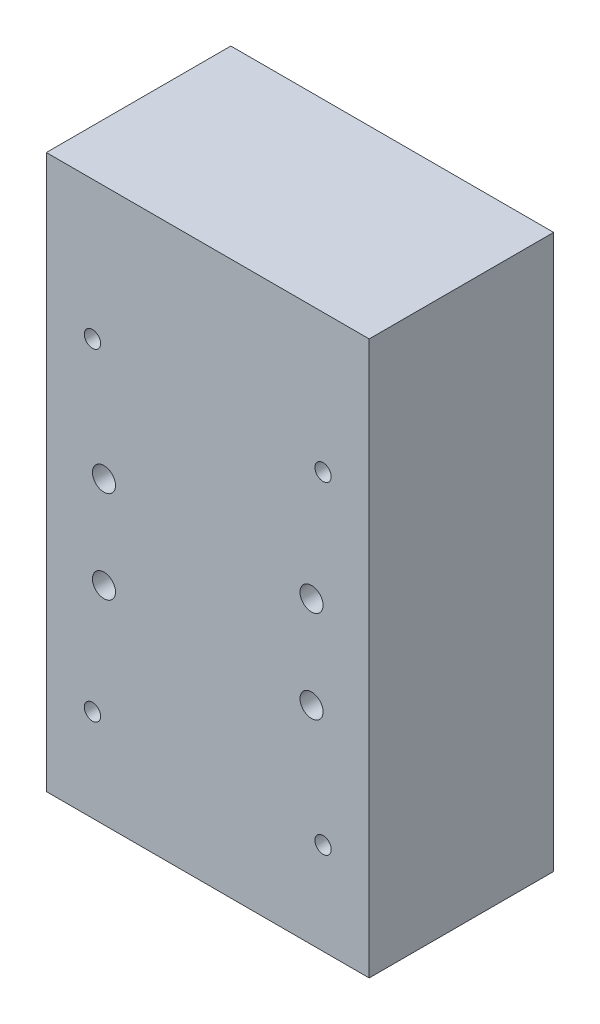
ISO-10303-21;
HEADER;
FILE_DESCRIPTION(('STEP AP214'),'2;1');
FILE_NAME('part.step','',(''),(''),'','','');
FILE_SCHEMA(('AUTOMOTIVE_DESIGN { 1 0 10303 214 1 1 1 1 }'));
ENDSEC;
DATA;
#1=APPLICATION_CONTEXT('core data for automotive mechanical design processes');
#2=APPLICATION_PROTOCOL_DEFINITION('international standard','automotive_design',2000,#1);
#3=PRODUCT_CONTEXT('',#1,'mechanical');
#4=PRODUCT('Part','Part','',(#3));
#5=PRODUCT_RELATED_PRODUCT_CATEGORY('part','',(#4));
#6=PRODUCT_DEFINITION_FORMATION('','',#4);
#7=PRODUCT_DEFINITION_CONTEXT('part definition',#1,'design');
#8=PRODUCT_DEFINITION('design','',#6,#7);
#9=PRODUCT_DEFINITION_SHAPE('','',#8);
#10=(LENGTH_UNIT() NAMED_UNIT(*) SI_UNIT(.MILLI.,.METRE.));
#11=(NAMED_UNIT(*) PLANE_ANGLE_UNIT() SI_UNIT($,.RADIAN.));
#12=(NAMED_UNIT(*) SI_UNIT($,.STERADIAN.) SOLID_ANGLE_UNIT());
#13=UNCERTAINTY_MEASURE_WITH_UNIT(LENGTH_MEASURE(1.E-05),#10,'distance_accuracy_value','');
#14=(GEOMETRIC_REPRESENTATION_CONTEXT(3) GLOBAL_UNCERTAINTY_ASSIGNED_CONTEXT((#13)) GLOBAL_UNIT_ASSIGNED_CONTEXT((#10,
#11,#12)) REPRESENTATION_CONTEXT('',''));
#15=CARTESIAN_POINT('',(0.,0.,0.));
#16=DIRECTION('',(0.,0.,1.));
#17=DIRECTION('',(1.,0.,0.));
#18=AXIS2_PLACEMENT_3D('',#15,#16,#17);
#19=CARTESIAN_POINT('',(-44.45,152.4,-25.4));
#20=DIRECTION('',(0.,0.,1.));
#21=DIRECTION('',(1.,0.,0.));
#22=AXIS2_PLACEMENT_3D('',#19,#20,#21);
#23=PLANE('',#22);
#24=CARTESIAN_POINT('',(28.5750000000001,82.5093987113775,-25.4000000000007));
#25=DIRECTION('',(0.,0.,-1.));
#26=DIRECTION('',(-1.,0.,0.));
#27=AXIS2_PLACEMENT_3D('',#24,#25,#26);
#28=CIRCLE('',#27,3.175);
#29=CARTESIAN_POINT('',(25.4000000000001,82.5093987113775,-25.4000000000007));
#30=VERTEX_POINT('',#29);
#31=EDGE_CURVE('E157',#30,#30,#28,.T.);
#32=ORIENTED_EDGE('',*,*,#31,.F.);
#33=EDGE_LOOP('',(#32));
#34=FACE_BOUND('',#33,.T.);
#35=CARTESIAN_POINT('',(-28.5749999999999,57.1093987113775,-25.4000000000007));
#36=DIRECTION('',(0.,0.,-1.));
#37=DIRECTION('',(-1.,0.,0.));
#38=AXIS2_PLACEMENT_3D('',#35,#36,#37);
#39=CIRCLE('',#38,3.175);
#40=CARTESIAN_POINT('',(-31.7499999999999,57.1093987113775,-25.4000000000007));
#41=VERTEX_POINT('',#40);
#42=EDGE_CURVE('E147',#41,#41,#39,.T.);
#43=ORIENTED_EDGE('',*,*,#42,.F.);
#44=EDGE_LOOP('',(#43));
#45=FACE_BOUND('',#44,.T.);
#46=CARTESIAN_POINT('',(31.75,114.3,-25.4));
#47=DIRECTION('',(0.,0.,-1.));
#48=DIRECTION('',(-1.,0.,0.));
#49=AXIS2_PLACEMENT_3D('',#46,#47,#48);
#50=CIRCLE('',#49,4.2164);
#51=CARTESIAN_POINT('',(27.5336,114.3,-25.4));
#52=VERTEX_POINT('',#51);
#53=EDGE_CURVE('E143',#52,#52,#50,.T.);
#54=ORIENTED_EDGE('',*,*,#53,.F.);
#55=EDGE_LOOP('',(#54));
#56=FACE_BOUND('',#55,.T.);
#57=CARTESIAN_POINT('',(-31.75,114.3,-25.4));
#58=DIRECTION('',(0.,0.,-1.));
#59=DIRECTION('',(-1.,0.,0.));
#60=AXIS2_PLACEMENT_3D('',#57,#58,#59);
#61=CIRCLE('',#60,4.2164);
#62=CARTESIAN_POINT('',(-35.9664,114.3,-25.4));
#63=VERTEX_POINT('',#62);
#64=EDGE_CURVE('E134',#63,#63,#61,.T.);
#65=ORIENTED_EDGE('',*,*,#64,.F.);
#66=EDGE_LOOP('',(#65));
#67=FACE_BOUND('',#66,.T.);
#68=CARTESIAN_POINT('',(31.75,25.4,-25.4));
#69=DIRECTION('',(0.,0.,-1.));
#70=DIRECTION('',(-1.,0.,0.));
#71=AXIS2_PLACEMENT_3D('',#68,#69,#70);
#72=CIRCLE('',#71,4.2164);
#73=CARTESIAN_POINT('',(27.5336,25.4,-25.4));
#74=VERTEX_POINT('',#73);
#75=EDGE_CURVE('E125',#74,#74,#72,.T.);
#76=ORIENTED_EDGE('',*,*,#75,.F.);
#77=EDGE_LOOP('',(#76));
#78=FACE_BOUND('',#77,.T.);
#79=CARTESIAN_POINT('',(-31.75,25.4,-25.4));
#80=DIRECTION('',(0.,0.,-1.));
#81=DIRECTION('',(-1.,0.,0.));
#82=AXIS2_PLACEMENT_3D('',#79,#80,#81);
#83=CIRCLE('',#82,4.2164);
#84=CARTESIAN_POINT('',(-35.9664,25.4,-25.4));
#85=VERTEX_POINT('',#84);
#86=EDGE_CURVE('E116',#85,#85,#83,.T.);
#87=ORIENTED_EDGE('',*,*,#86,.F.);
#88=EDGE_LOOP('',(#87));
#89=FACE_BOUND('',#88,.T.);
#90=DIRECTION('',(-1.,0.,0.));
#91=VECTOR('',#90,1.);
#92=CARTESIAN_POINT('',(-44.45,0.,-25.4));
#93=LINE('',#92,#91);
#94=CARTESIAN_POINT('',(44.45,0.,-25.4));
#95=VERTEX_POINT('',#94);
#96=CARTESIAN_POINT('',(-44.45,0.,-25.4));
#97=VERTEX_POINT('',#96);
#98=EDGE_CURVE('E88',#95,#97,#93,.T.);
#99=ORIENTED_EDGE('',*,*,#98,.T.);
#100=DIRECTION('',(0.,-1.,0.));
#101=VECTOR('',#100,1.);
#102=CARTESIAN_POINT('',(-44.45,152.4,-25.4));
#103=LINE('',#102,#101);
#104=CARTESIAN_POINT('',(-44.45,152.4,-25.4));
#105=VERTEX_POINT('',#104);
#106=EDGE_CURVE('E41',#105,#97,#103,.T.);
#107=ORIENTED_EDGE('',*,*,#106,.F.);
#108=DIRECTION('',(-1.,0.,0.));
#109=VECTOR('',#108,1.);
#110=CARTESIAN_POINT('',(-44.45,152.4,-25.4));
#111=LINE('',#110,#109);
#112=CARTESIAN_POINT('',(44.45,152.4,-25.4));
#113=VERTEX_POINT('',#112);
#114=EDGE_CURVE('E79',#113,#105,#111,.T.);
#115=ORIENTED_EDGE('',*,*,#114,.F.);
#116=DIRECTION('',(0.,-1.,0.));
#117=VECTOR('',#116,1.);
#118=CARTESIAN_POINT('',(44.45,152.4,-25.4));
#119=LINE('',#118,#117);
#120=EDGE_CURVE('E11',#113,#95,#119,.T.);
#121=ORIENTED_EDGE('',*,*,#120,.T.);
#122=EDGE_LOOP('',(#99,#107,#115,#121));
#123=FACE_BOUND('',#122,.T.);
#124=CARTESIAN_POINT('',(-28.5749999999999,82.5093987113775,-25.4000000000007));
#125=DIRECTION('',(0.,0.,1.));
#126=DIRECTION('',(1.,0.,0.));
#127=AXIS2_PLACEMENT_3D('',#124,#125,#126);
#128=CIRCLE('',#127,3.175);
#129=CARTESIAN_POINT('',(-25.3999999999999,82.5093987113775,-25.4000000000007));
#130=VERTEX_POINT('',#129);
#131=EDGE_CURVE('E156',#130,#130,#128,.T.);
#132=ORIENTED_EDGE('',*,*,#131,.T.);
#133=EDGE_LOOP('',(#132));
#134=FACE_BOUND('',#133,.T.);
#135=CARTESIAN_POINT('',(28.5750000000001,57.1093987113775,-25.4000000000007));
#136=DIRECTION('',(0.,0.,1.));
#137=DIRECTION('',(1.,0.,0.));
#138=AXIS2_PLACEMENT_3D('',#135,#136,#137);
#139=CIRCLE('',#138,3.175);
#140=CARTESIAN_POINT('',(31.7500000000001,57.1093987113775,-25.4000000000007));
#141=VERTEX_POINT('',#140);
#142=EDGE_CURVE('E150',#141,#141,#139,.T.);
#143=ORIENTED_EDGE('',*,*,#142,.T.);
#144=EDGE_LOOP('',(#143));
#145=FACE_BOUND('',#144,.T.);
#146=ADVANCED_FACE('F32',(#34,#45,#56,#67,#78,#89,#123,#134,#145),#23,.F.);
#147=CARTESIAN_POINT('',(-44.45,152.4,25.4));
#148=DIRECTION('',(0.,0.,-1.));
#149=DIRECTION('',(-1.,0.,0.));
#150=AXIS2_PLACEMENT_3D('',#147,#148,#149);
#151=PLANE('',#150);
#152=CARTESIAN_POINT('',(28.5750000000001,82.5093987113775,25.4));
#153=DIRECTION('',(0.,0.,-1.));
#154=DIRECTION('',(-1.,0.,0.));
#155=AXIS2_PLACEMENT_3D('',#152,#153,#154);
#156=CIRCLE('',#155,3.175);
#157=CARTESIAN_POINT('',(25.4000000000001,82.5093987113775,25.4));
#158=VERTEX_POINT('',#157);
#159=EDGE_CURVE('E165',#158,#158,#156,.T.);
#160=ORIENTED_EDGE('',*,*,#159,.T.);
#161=EDGE_LOOP('',(#160));
#162=FACE_BOUND('',#161,.T.);
#163=CARTESIAN_POINT('',(-28.5749999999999,57.1093987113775,25.4));
#164=DIRECTION('',(0.,0.,-1.));
#165=DIRECTION('',(-1.,0.,0.));
#166=AXIS2_PLACEMENT_3D('',#163,#164,#165);
#167=CIRCLE('',#166,3.175);
#168=CARTESIAN_POINT('',(-31.7499999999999,57.1093987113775,25.4));
#169=VERTEX_POINT('',#168);
#170=EDGE_CURVE('E146',#169,#169,#167,.T.);
#171=ORIENTED_EDGE('',*,*,#170,.T.);
#172=EDGE_LOOP('',(#171));
#173=FACE_BOUND('',#172,.T.);
#174=CARTESIAN_POINT('',(31.75,114.3,25.4));
#175=DIRECTION('',(0.,0.,-1.));
#176=DIRECTION('',(-1.,0.,0.));
#177=AXIS2_PLACEMENT_3D('',#174,#175,#176);
#178=CIRCLE('',#177,2.24789999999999);
#179=CARTESIAN_POINT('',(29.5021,114.3,25.4));
#180=VERTEX_POINT('',#179);
#181=EDGE_CURVE('E137',#180,#180,#178,.T.);
#182=ORIENTED_EDGE('',*,*,#181,.T.);
#183=EDGE_LOOP('',(#182));
#184=FACE_BOUND('',#183,.T.);
#185=CARTESIAN_POINT('',(-31.75,114.3,25.4));
#186=DIRECTION('',(0.,0.,-1.));
#187=DIRECTION('',(-1.,0.,0.));
#188=AXIS2_PLACEMENT_3D('',#185,#186,#187);
#189=CIRCLE('',#188,2.24789999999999);
#190=CARTESIAN_POINT('',(-33.9979,114.3,25.4));
#191=VERTEX_POINT('',#190);
#192=EDGE_CURVE('E128',#191,#191,#189,.T.);
#193=ORIENTED_EDGE('',*,*,#192,.T.);
#194=EDGE_LOOP('',(#193));
#195=FACE_BOUND('',#194,.T.);
#196=CARTESIAN_POINT('',(31.75,25.4,25.4));
#197=DIRECTION('',(0.,0.,-1.));
#198=DIRECTION('',(-1.,0.,0.));
#199=AXIS2_PLACEMENT_3D('',#196,#197,#198);
#200=CIRCLE('',#199,2.24789999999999);
#201=CARTESIAN_POINT('',(29.5021,25.4,25.4));
#202=VERTEX_POINT('',#201);
#203=EDGE_CURVE('E119',#202,#202,#200,.T.);
#204=ORIENTED_EDGE('',*,*,#203,.T.);
#205=EDGE_LOOP('',(#204));
#206=FACE_BOUND('',#205,.T.);
#207=CARTESIAN_POINT('',(-31.75,25.4,25.4));
#208=DIRECTION('',(0.,0.,-1.));
#209=DIRECTION('',(-1.,0.,0.));
#210=AXIS2_PLACEMENT_3D('',#207,#208,#209);
#211=CIRCLE('',#210,2.24789999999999);
#212=CARTESIAN_POINT('',(-33.9979,25.4,25.4));
#213=VERTEX_POINT('',#212);
#214=EDGE_CURVE('E99',#213,#213,#211,.T.);
#215=ORIENTED_EDGE('',*,*,#214,.T.);
#216=EDGE_LOOP('',(#215));
#217=FACE_BOUND('',#216,.T.);
#218=DIRECTION('',(1.,0.,0.));
#219=VECTOR('',#218,1.);
#220=CARTESIAN_POINT('',(-44.45,0.,25.4));
#221=LINE('',#220,#219);
#222=CARTESIAN_POINT('',(-44.45,0.,25.4));
#223=VERTEX_POINT('',#222);
#224=CARTESIAN_POINT('',(44.45,0.,25.4));
#225=VERTEX_POINT('',#224);
#226=EDGE_CURVE('E72',#223,#225,#221,.T.);
#227=ORIENTED_EDGE('',*,*,#226,.T.);
#228=DIRECTION('',(0.,-1.,0.));
#229=VECTOR('',#228,1.);
#230=CARTESIAN_POINT('',(44.45,152.4,25.4));
#231=LINE('',#230,#229);
#232=CARTESIAN_POINT('',(44.45,152.4,25.4));
#233=VERTEX_POINT('',#232);
#234=EDGE_CURVE('E92',#233,#225,#231,.T.);
#235=ORIENTED_EDGE('',*,*,#234,.F.);
#236=DIRECTION('',(1.,0.,0.));
#237=VECTOR('',#236,1.);
#238=CARTESIAN_POINT('',(-44.45,152.4,25.4));
#239=LINE('',#238,#237);
#240=CARTESIAN_POINT('',(-44.45,152.4,25.4));
#241=VERTEX_POINT('',#240);
#242=EDGE_CURVE('E49',#241,#233,#239,.T.);
#243=ORIENTED_EDGE('',*,*,#242,.F.);
#244=DIRECTION('',(0.,-1.,0.));
#245=VECTOR('',#244,1.);
#246=CARTESIAN_POINT('',(-44.45,152.4,25.4));
#247=LINE('',#246,#245);
#248=EDGE_CURVE('E89',#241,#223,#247,.T.);
#249=ORIENTED_EDGE('',*,*,#248,.T.);
#250=EDGE_LOOP('',(#227,#235,#243,#249));
#251=FACE_BOUND('',#250,.T.);
#252=CARTESIAN_POINT('',(-28.5749999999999,82.5093987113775,25.4));
#253=DIRECTION('',(0.,0.,1.));
#254=DIRECTION('',(1.,0.,0.));
#255=AXIS2_PLACEMENT_3D('',#252,#253,#254);
#256=CIRCLE('',#255,3.175);
#257=CARTESIAN_POINT('',(-25.3999999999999,82.5093987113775,25.4));
#258=VERTEX_POINT('',#257);
#259=EDGE_CURVE('E153',#258,#258,#256,.T.);
#260=ORIENTED_EDGE('',*,*,#259,.F.);
#261=EDGE_LOOP('',(#260));
#262=FACE_BOUND('',#261,.T.);
#263=CARTESIAN_POINT('',(28.5750000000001,57.1093987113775,25.4));
#264=DIRECTION('',(0.,0.,1.));
#265=DIRECTION('',(1.,0.,0.));
#266=AXIS2_PLACEMENT_3D('',#263,#264,#265);
#267=CIRCLE('',#266,3.175);
#268=CARTESIAN_POINT('',(31.7500000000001,57.1093987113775,25.4));
#269=VERTEX_POINT('',#268);
#270=EDGE_CURVE('E160',#269,#269,#267,.T.);
#271=ORIENTED_EDGE('',*,*,#270,.F.);
#272=EDGE_LOOP('',(#271));
#273=FACE_BOUND('',#272,.T.);
#274=ADVANCED_FACE('F104',(#162,#173,#184,#195,#206,#217,#251,#262,#273),#151,.F.);
#275=CARTESIAN_POINT('',(44.45,152.4,-25.4));
#276=DIRECTION('',(-1.,0.,0.));
#277=DIRECTION('',(0.,0.,1.));
#278=AXIS2_PLACEMENT_3D('',#275,#276,#277);
#279=PLANE('',#278);
#280=DIRECTION('',(0.,0.,-1.));
#281=VECTOR('',#280,1.);
#282=CARTESIAN_POINT('',(44.45,0.,-25.4));
#283=LINE('',#282,#281);
#284=EDGE_CURVE('E96',#225,#95,#283,.T.);
#285=ORIENTED_EDGE('',*,*,#284,.T.);
#286=ORIENTED_EDGE('',*,*,#120,.F.);
#287=DIRECTION('',(0.,0.,-1.));
#288=VECTOR('',#287,1.);
#289=CARTESIAN_POINT('',(44.45,152.4,-25.4));
#290=LINE('',#289,#288);
#291=EDGE_CURVE('E84',#233,#113,#290,.T.);
#292=ORIENTED_EDGE('',*,*,#291,.F.);
#293=ORIENTED_EDGE('',*,*,#234,.T.);
#294=EDGE_LOOP('',(#285,#286,#292,#293));
#295=FACE_BOUND('',#294,.T.);
#296=ADVANCED_FACE('F34',(#295),#279,.F.);
#297=CARTESIAN_POINT('',(-44.45,152.4,-25.4));
#298=DIRECTION('',(1.,0.,0.));
#299=DIRECTION('',(0.,0.,-1.));
#300=AXIS2_PLACEMENT_3D('',#297,#298,#299);
#301=PLANE('',#300);
#302=DIRECTION('',(0.,0.,1.));
#303=VECTOR('',#302,1.);
#304=CARTESIAN_POINT('',(-44.45,0.,-25.4));
#305=LINE('',#304,#303);
#306=EDGE_CURVE('E66',#97,#223,#305,.T.);
#307=ORIENTED_EDGE('',*,*,#306,.T.);
#308=ORIENTED_EDGE('',*,*,#248,.F.);
#309=DIRECTION('',(0.,0.,1.));
#310=VECTOR('',#309,1.);
#311=CARTESIAN_POINT('',(-44.45,152.4,-25.4));
#312=LINE('',#311,#310);
#313=EDGE_CURVE('E82',#105,#241,#312,.T.);
#314=ORIENTED_EDGE('',*,*,#313,.F.);
#315=ORIENTED_EDGE('',*,*,#106,.T.);
#316=EDGE_LOOP('',(#307,#308,#314,#315));
#317=FACE_BOUND('',#316,.T.);
#318=ADVANCED_FACE('F90',(#317),#301,.F.);
#319=CARTESIAN_POINT('',(0.,152.4,0.));
#320=DIRECTION('',(0.,1.,0.));
#321=DIRECTION('',(0.,0.,1.));
#322=AXIS2_PLACEMENT_3D('',#319,#320,#321);
#323=PLANE('',#322);
#324=ORIENTED_EDGE('',*,*,#291,.T.);
#325=ORIENTED_EDGE('',*,*,#114,.T.);
#326=ORIENTED_EDGE('',*,*,#313,.T.);
#327=ORIENTED_EDGE('',*,*,#242,.T.);
#328=EDGE_LOOP('',(#324,#325,#326,#327));
#329=FACE_BOUND('',#328,.T.);
#330=ADVANCED_FACE('F80',(#329),#323,.T.);
#331=CARTESIAN_POINT('',(0.,0.,0.));
#332=DIRECTION('',(0.,1.,0.));
#333=DIRECTION('',(0.,0.,1.));
#334=AXIS2_PLACEMENT_3D('',#331,#332,#333);
#335=PLANE('',#334);
#336=ORIENTED_EDGE('',*,*,#284,.F.);
#337=ORIENTED_EDGE('',*,*,#226,.F.);
#338=ORIENTED_EDGE('',*,*,#306,.F.);
#339=ORIENTED_EDGE('',*,*,#98,.F.);
#340=EDGE_LOOP('',(#336,#337,#338,#339));
#341=FACE_BOUND('',#340,.T.);
#342=ADVANCED_FACE('F108',(#341),#335,.F.);
#343=CARTESIAN_POINT('',(-31.75,25.4,-25.4));
#344=DIRECTION('',(0.,0.,-1.));
#345=DIRECTION('',(-1.,0.,0.));
#346=AXIS2_PLACEMENT_3D('',#343,#344,#345);
#347=CYLINDRICAL_SURFACE('',#346,2.24789999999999);
#348=ORIENTED_EDGE('',*,*,#214,.F.);
#349=EDGE_LOOP('',(#348));
#350=FACE_BOUND('',#349,.T.);
#351=CARTESIAN_POINT('',(-31.75,25.4,-23.7482323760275));
#352=DIRECTION('',(0.,0.,-1.));
#353=DIRECTION('',(-1.,0.,0.));
#354=AXIS2_PLACEMENT_3D('',#351,#352,#353);
#355=CIRCLE('',#354,2.24789999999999);
#356=CARTESIAN_POINT('',(-33.9979,25.4,-23.7482323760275));
#357=VERTEX_POINT('',#356);
#358=EDGE_CURVE('E113',#357,#357,#355,.T.);
#359=ORIENTED_EDGE('',*,*,#358,.T.);
#360=EDGE_LOOP('',(#359));
#361=FACE_BOUND('',#360,.T.);
#362=ADVANCED_FACE('F188',(#350,#361),#347,.F.);
#363=CARTESIAN_POINT('',(-31.75,25.4,-25.4));
#364=DIRECTION('',(0.,0.,-1.));
#365=DIRECTION('',(-1.,0.,0.));
#366=AXIS2_PLACEMENT_3D('',#363,#364,#365);
#367=CONICAL_SURFACE('',#366,4.2164,0.87266462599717);
#368=ORIENTED_EDGE('',*,*,#358,.F.);
#369=EDGE_LOOP('',(#368));
#370=FACE_BOUND('',#369,.T.);
#371=ORIENTED_EDGE('',*,*,#86,.T.);
#372=EDGE_LOOP('',(#371));
#373=FACE_BOUND('',#372,.T.);
#374=ADVANCED_FACE('F185',(#370,#373),#367,.F.);
#375=CARTESIAN_POINT('',(31.75,25.4,-25.4));
#376=DIRECTION('',(0.,0.,-1.));
#377=DIRECTION('',(-1.,0.,0.));
#378=AXIS2_PLACEMENT_3D('',#375,#376,#377);
#379=CYLINDRICAL_SURFACE('',#378,2.24789999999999);
#380=ORIENTED_EDGE('',*,*,#203,.F.);
#381=EDGE_LOOP('',(#380));
#382=FACE_BOUND('',#381,.T.);
#383=CARTESIAN_POINT('',(31.75,25.4,-23.7482323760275));
#384=DIRECTION('',(0.,0.,-1.));
#385=DIRECTION('',(-1.,0.,0.));
#386=AXIS2_PLACEMENT_3D('',#383,#384,#385);
#387=CIRCLE('',#386,2.24789999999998);
#388=CARTESIAN_POINT('',(29.5021,25.4,-23.7482323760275));
#389=VERTEX_POINT('',#388);
#390=EDGE_CURVE('E122',#389,#389,#387,.T.);
#391=ORIENTED_EDGE('',*,*,#390,.T.);
#392=EDGE_LOOP('',(#391));
#393=FACE_BOUND('',#392,.T.);
#394=ADVANCED_FACE('F187',(#382,#393),#379,.F.);
#395=CARTESIAN_POINT('',(31.75,25.4,-25.4));
#396=DIRECTION('',(0.,0.,-1.));
#397=DIRECTION('',(-1.,0.,0.));
#398=AXIS2_PLACEMENT_3D('',#395,#396,#397);
#399=CONICAL_SURFACE('',#398,4.2164,0.87266462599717);
#400=ORIENTED_EDGE('',*,*,#390,.F.);
#401=EDGE_LOOP('',(#400));
#402=FACE_BOUND('',#401,.T.);
#403=ORIENTED_EDGE('',*,*,#75,.T.);
#404=EDGE_LOOP('',(#403));
#405=FACE_BOUND('',#404,.T.);
#406=ADVANCED_FACE('F195',(#402,#405),#399,.F.);
#407=CARTESIAN_POINT('',(-31.75,114.3,-25.4));
#408=DIRECTION('',(0.,0.,-1.));
#409=DIRECTION('',(-1.,0.,0.));
#410=AXIS2_PLACEMENT_3D('',#407,#408,#409);
#411=CYLINDRICAL_SURFACE('',#410,2.24789999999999);
#412=ORIENTED_EDGE('',*,*,#192,.F.);
#413=EDGE_LOOP('',(#412));
#414=FACE_BOUND('',#413,.T.);
#415=CARTESIAN_POINT('',(-31.75,114.3,-23.7482323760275));
#416=DIRECTION('',(0.,0.,-1.));
#417=DIRECTION('',(-1.,0.,0.));
#418=AXIS2_PLACEMENT_3D('',#415,#416,#417);
#419=CIRCLE('',#418,2.24789999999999);
#420=CARTESIAN_POINT('',(-33.9979,114.3,-23.7482323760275));
#421=VERTEX_POINT('',#420);
#422=EDGE_CURVE('E131',#421,#421,#419,.T.);
#423=ORIENTED_EDGE('',*,*,#422,.T.);
#424=EDGE_LOOP('',(#423));
#425=FACE_BOUND('',#424,.T.);
#426=ADVANCED_FACE('F258',(#414,#425),#411,.F.);
#427=CARTESIAN_POINT('',(-31.75,114.3,-25.4));
#428=DIRECTION('',(0.,0.,-1.));
#429=DIRECTION('',(-1.,0.,0.));
#430=AXIS2_PLACEMENT_3D('',#427,#428,#429);
#431=CONICAL_SURFACE('',#430,4.2164,0.87266462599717);
#432=ORIENTED_EDGE('',*,*,#422,.F.);
#433=EDGE_LOOP('',(#432));
#434=FACE_BOUND('',#433,.T.);
#435=ORIENTED_EDGE('',*,*,#64,.T.);
#436=EDGE_LOOP('',(#435));
#437=FACE_BOUND('',#436,.T.);
#438=ADVANCED_FACE('F248',(#434,#437),#431,.F.);
#439=CARTESIAN_POINT('',(31.75,114.3,-25.4));
#440=DIRECTION('',(0.,0.,-1.));
#441=DIRECTION('',(-1.,0.,0.));
#442=AXIS2_PLACEMENT_3D('',#439,#440,#441);
#443=CYLINDRICAL_SURFACE('',#442,2.24789999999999);
#444=ORIENTED_EDGE('',*,*,#181,.F.);
#445=EDGE_LOOP('',(#444));
#446=FACE_BOUND('',#445,.T.);
#447=CARTESIAN_POINT('',(31.75,114.3,-23.7482323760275));
#448=DIRECTION('',(0.,0.,-1.));
#449=DIRECTION('',(-1.,0.,0.));
#450=AXIS2_PLACEMENT_3D('',#447,#448,#449);
#451=CIRCLE('',#450,2.24789999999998);
#452=CARTESIAN_POINT('',(29.5021,114.3,-23.7482323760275));
#453=VERTEX_POINT('',#452);
#454=EDGE_CURVE('E140',#453,#453,#451,.T.);
#455=ORIENTED_EDGE('',*,*,#454,.T.);
#456=EDGE_LOOP('',(#455));
#457=FACE_BOUND('',#456,.T.);
#458=ADVANCED_FACE('F237',(#446,#457),#443,.F.);
#459=CARTESIAN_POINT('',(31.75,114.3,-25.4));
#460=DIRECTION('',(0.,0.,-1.));
#461=DIRECTION('',(-1.,0.,0.));
#462=AXIS2_PLACEMENT_3D('',#459,#460,#461);
#463=CONICAL_SURFACE('',#462,4.2164,0.87266462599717);
#464=ORIENTED_EDGE('',*,*,#454,.F.);
#465=EDGE_LOOP('',(#464));
#466=FACE_BOUND('',#465,.T.);
#467=ORIENTED_EDGE('',*,*,#53,.T.);
#468=EDGE_LOOP('',(#467));
#469=FACE_BOUND('',#468,.T.);
#470=ADVANCED_FACE('F231',(#466,#469),#463,.F.);
#471=CARTESIAN_POINT('',(-28.5749999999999,57.1093987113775,25.4));
#472=DIRECTION('',(0.,0.,-1.));
#473=DIRECTION('',(-1.,0.,0.));
#474=AXIS2_PLACEMENT_3D('',#471,#472,#473);
#475=CYLINDRICAL_SURFACE('',#474,3.175);
#476=ORIENTED_EDGE('',*,*,#170,.F.);
#477=EDGE_LOOP('',(#476));
#478=FACE_BOUND('',#477,.T.);
#479=ORIENTED_EDGE('',*,*,#42,.T.);
#480=EDGE_LOOP('',(#479));
#481=FACE_BOUND('',#480,.T.);
#482=ADVANCED_FACE('F236',(#478,#481),#475,.F.);
#483=CARTESIAN_POINT('',(28.5750000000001,82.5093987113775,25.4));
#484=DIRECTION('',(0.,0.,-1.));
#485=DIRECTION('',(-1.,0.,0.));
#486=AXIS2_PLACEMENT_3D('',#483,#484,#485);
#487=CYLINDRICAL_SURFACE('',#486,3.175);
#488=ORIENTED_EDGE('',*,*,#159,.F.);
#489=EDGE_LOOP('',(#488));
#490=FACE_BOUND('',#489,.T.);
#491=ORIENTED_EDGE('',*,*,#31,.T.);
#492=EDGE_LOOP('',(#491));
#493=FACE_BOUND('',#492,.T.);
#494=ADVANCED_FACE('F171',(#490,#493),#487,.F.);
#495=CARTESIAN_POINT('',(-28.5749999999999,82.5093987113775,25.4));
#496=DIRECTION('',(0.,0.,-1.));
#497=DIRECTION('',(-1.,0.,0.));
#498=AXIS2_PLACEMENT_3D('',#495,#496,#497);
#499=CYLINDRICAL_SURFACE('',#498,3.175);
#500=ORIENTED_EDGE('',*,*,#259,.T.);
#501=EDGE_LOOP('',(#500));
#502=FACE_BOUND('',#501,.T.);
#503=ORIENTED_EDGE('',*,*,#131,.F.);
#504=EDGE_LOOP('',(#503));
#505=FACE_BOUND('',#504,.T.);
#506=ADVANCED_FACE('F319',(#502,#505),#499,.F.);
#507=CARTESIAN_POINT('',(28.5750000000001,57.1093987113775,25.4));
#508=DIRECTION('',(0.,0.,-1.));
#509=DIRECTION('',(-1.,0.,0.));
#510=AXIS2_PLACEMENT_3D('',#507,#508,#509);
#511=CYLINDRICAL_SURFACE('',#510,3.175);
#512=ORIENTED_EDGE('',*,*,#270,.T.);
#513=EDGE_LOOP('',(#512));
#514=FACE_BOUND('',#513,.T.);
#515=ORIENTED_EDGE('',*,*,#142,.F.);
#516=EDGE_LOOP('',(#515));
#517=FACE_BOUND('',#516,.T.);
#518=ADVANCED_FACE('F322',(#514,#517),#511,.F.);
#519=CLOSED_SHELL('',(#146,#274,#296,#318,#330,#342,#362,#374,#394,#406,#426,#438,#458,#470,
#482,#494,#506,#518));
#520=MANIFOLD_SOLID_BREP('B2',#519);
#521=ADVANCED_BREP_SHAPE_REPRESENTATION('',(#18,#520),#14);
#522=SHAPE_DEFINITION_REPRESENTATION(#9,#521);
ENDSEC;
END-ISO-10303-21;
